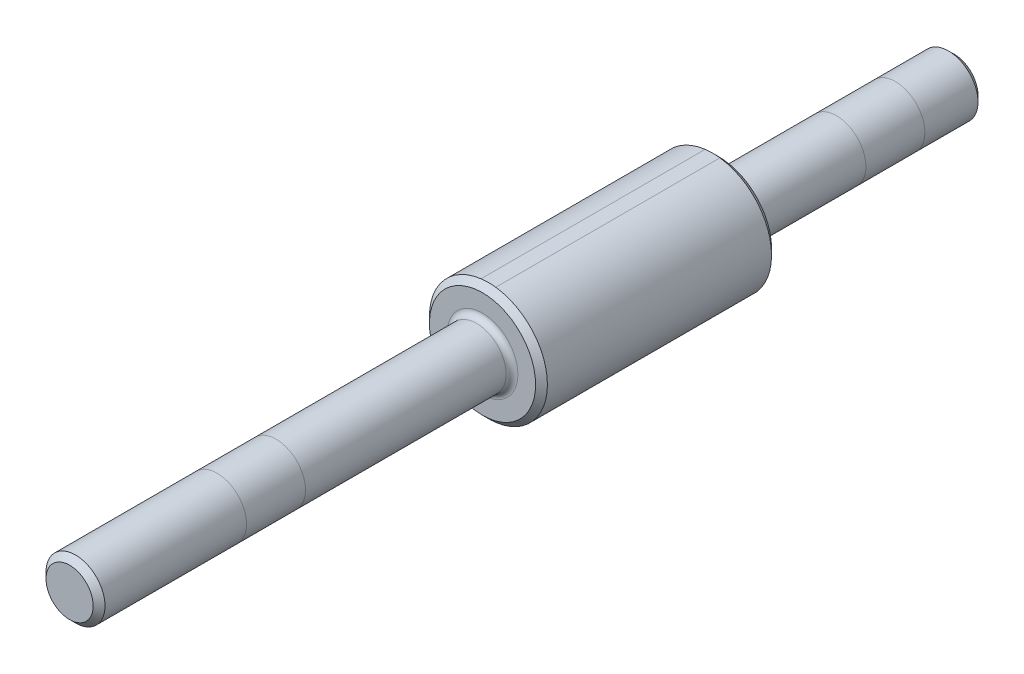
from build123d import *

# Parameters (mm, degrees)
SKETCH1_R           = 5
BOSS_EXTRUDE1_DEPTH = 150
SKETCH2_R           = 10
BOSS_EXTRUDE2_DEPTH = 40
FILLET1_R           = 1
CHAMFER1_SIZE       = 1


with BuildPart() as part:
    # Sketch1 → Boss-Extrude1 (new body)
    with BuildSketch(Plane.XY):
        Circle(SKETCH1_R)
    extrude(amount=BOSS_EXTRUDE1_DEPTH)

    # Sketch2 → Boss-Extrude2 (add)
    with BuildSketch(Plane.XY.offset(40)):
        with Locations(Location((0, 0, 0), (0, 0, 180))):
            Circle(SKETCH2_R)
    extrude(amount=BOSS_EXTRUDE2_DEPTH)

    # Fillet1
    fillet1_edges = [part.edges().sort_by_distance(p)[0] for p in [
        (-5, 0, 40),
        (-5, 0, 80),
    ]]
    fillet(fillet1_edges, radius=FILLET1_R)

    # Chamfer1
    chamfer1_edges = [part.edges().sort_by_distance(p)[0] for p in [
        (-5, 0, 0),
        (-5, 0, 150),
        (10, 0, 80),
        (10, 0, 40),
    ]]
    chamfer(chamfer1_edges, length=CHAMFER1_SIZE)


solid = part.part
